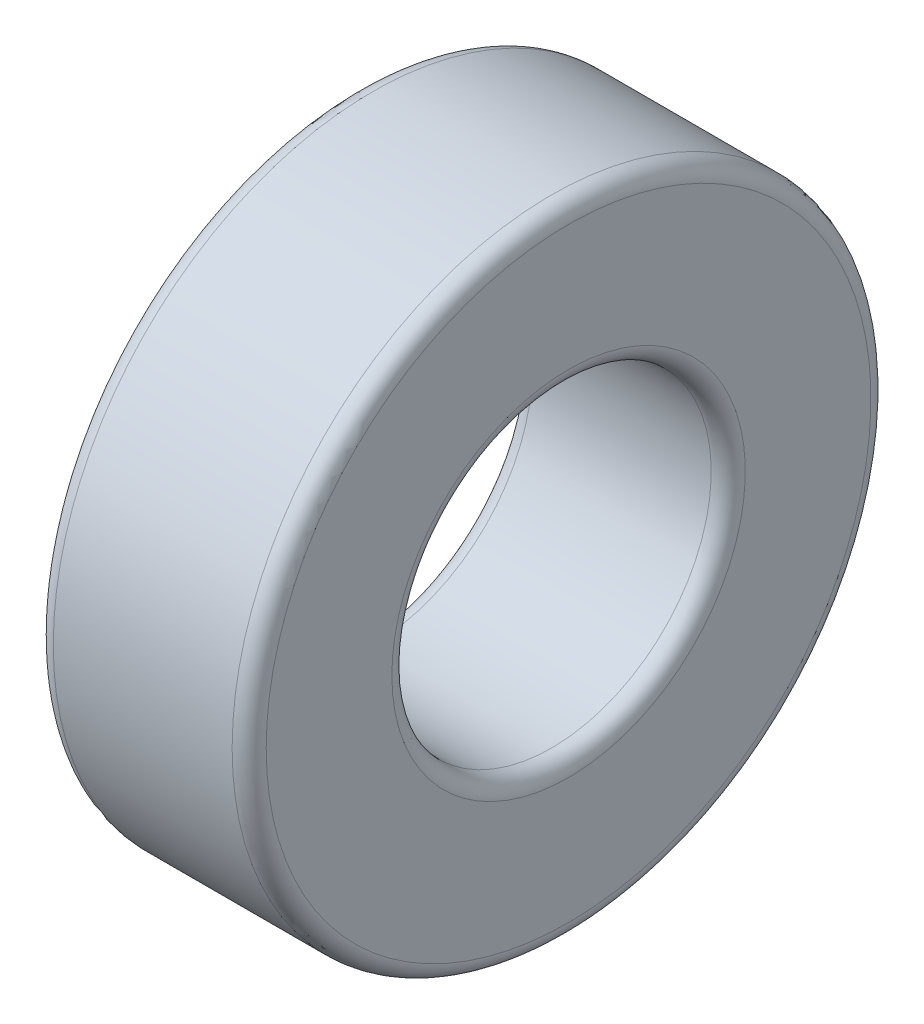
from build123d import *

# Parameters (mm, degrees)
SKETCH1_W = 3.175
SKETCH1_H = 2.38125
FILLET2_R = 0.254


with BuildPart() as part:
    # Sketch1 → Revolve1 (revolve)
    with BuildSketch(Plane.XY, mode=Mode.PRIVATE) as revolve1_sk:
        with Locations((0, 3.571875)):
            Rectangle(SKETCH1_W, SKETCH1_H)
    revolve(revolve1_sk.sketch.rotate(Axis((0, 0, 0), (1, 0, 0)), 90), axis=Axis((0, 0, 0), (1, 0, 0)))

    # Fillet2
    fillet2_edges = [part.edges().sort_by_distance(p)[0] for p in [
        (-1.5875, 0, -2.38125),
        (1.5875, 0, -2.38125),
        (1.5875, 0, -4.7625),
        (-1.5875, 0, -4.7625),
    ]]
    fillet(fillet2_edges, radius=FILLET2_R)


solid = part.part
